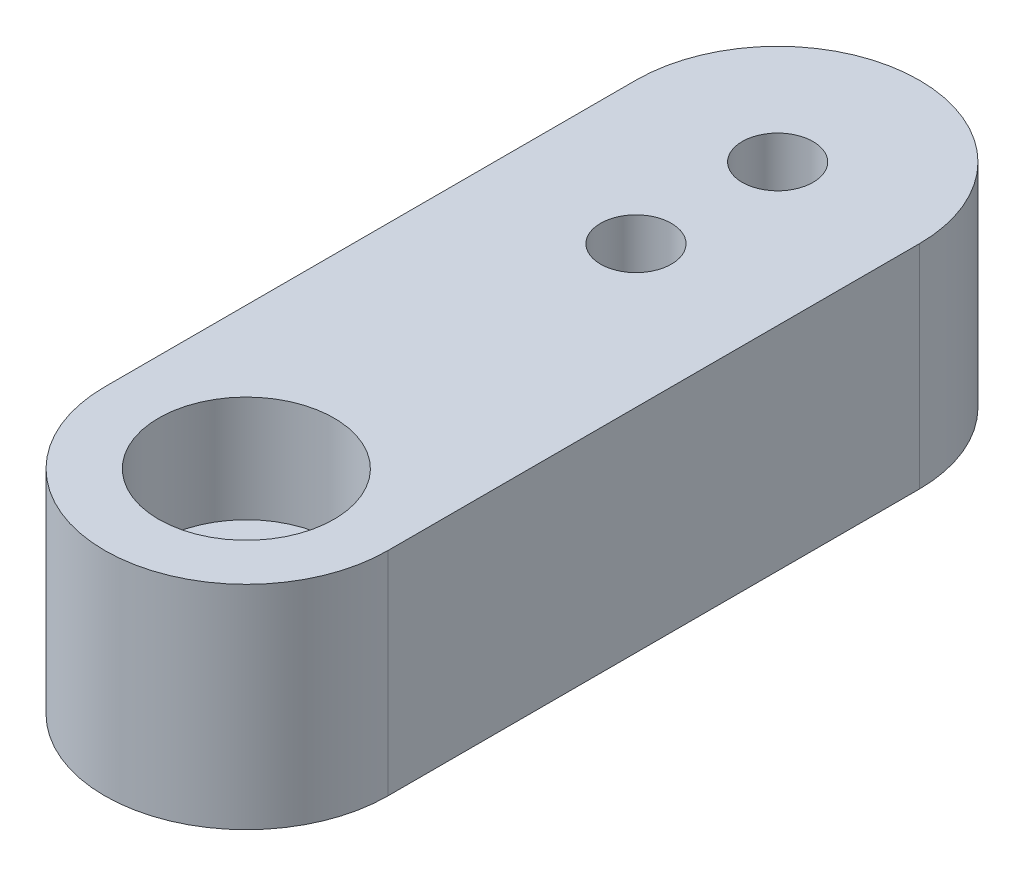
ISO-10303-21;
HEADER;
FILE_DESCRIPTION(('STEP AP214'),'2;1');
FILE_NAME('part.step','',(''),(''),'','','');
FILE_SCHEMA(('AUTOMOTIVE_DESIGN { 1 0 10303 214 1 1 1 1 }'));
ENDSEC;
DATA;
#1=APPLICATION_CONTEXT('core data for automotive mechanical design processes');
#2=APPLICATION_PROTOCOL_DEFINITION('international standard','automotive_design',2000,#1);
#3=PRODUCT_CONTEXT('',#1,'mechanical');
#4=PRODUCT('Part','Part','',(#3));
#5=PRODUCT_RELATED_PRODUCT_CATEGORY('part','',(#4));
#6=PRODUCT_DEFINITION_FORMATION('','',#4);
#7=PRODUCT_DEFINITION_CONTEXT('part definition',#1,'design');
#8=PRODUCT_DEFINITION('design','',#6,#7);
#9=PRODUCT_DEFINITION_SHAPE('','',#8);
#10=(LENGTH_UNIT() NAMED_UNIT(*) SI_UNIT(.MILLI.,.METRE.));
#11=(NAMED_UNIT(*) PLANE_ANGLE_UNIT() SI_UNIT($,.RADIAN.));
#12=(NAMED_UNIT(*) SI_UNIT($,.STERADIAN.) SOLID_ANGLE_UNIT());
#13=UNCERTAINTY_MEASURE_WITH_UNIT(LENGTH_MEASURE(1.E-05),#10,'distance_accuracy_value','');
#14=(GEOMETRIC_REPRESENTATION_CONTEXT(3) GLOBAL_UNCERTAINTY_ASSIGNED_CONTEXT((#13)) GLOBAL_UNIT_ASSIGNED_CONTEXT((#10,
#11,#12)) REPRESENTATION_CONTEXT('',''));
#15=CARTESIAN_POINT('',(0.,0.,0.));
#16=DIRECTION('',(0.,0.,1.));
#17=DIRECTION('',(1.,0.,0.));
#18=AXIS2_PLACEMENT_3D('',#15,#16,#17);
#19=CARTESIAN_POINT('',(4.,6.,15.));
#20=DIRECTION('',(0.,-1.,0.));
#21=DIRECTION('',(0.,0.,-1.));
#22=AXIS2_PLACEMENT_3D('',#19,#20,#21);
#23=CYLINDRICAL_SURFACE('',#22,1.);
#24=CARTESIAN_POINT('',(4.,0.,15.));
#25=DIRECTION('',(0.,1.,0.));
#26=DIRECTION('',(0.,0.,1.));
#27=AXIS2_PLACEMENT_3D('',#24,#25,#26);
#28=CIRCLE('',#27,1.);
#29=CARTESIAN_POINT('',(4.,0.,16.));
#30=VERTEX_POINT('',#29);
#31=EDGE_CURVE('E123',#30,#30,#28,.T.);
#32=ORIENTED_EDGE('',*,*,#31,.F.);
#33=EDGE_LOOP('',(#32));
#34=FACE_BOUND('',#33,.T.);
#35=CARTESIAN_POINT('',(4.,3.,15.));
#36=DIRECTION('',(0.,1.,0.));
#37=DIRECTION('',(0.,0.,1.));
#38=AXIS2_PLACEMENT_3D('',#35,#36,#37);
#39=CIRCLE('',#38,1.);
#40=CARTESIAN_POINT('',(4.,3.,16.));
#41=VERTEX_POINT('',#40);
#42=EDGE_CURVE('E36',#41,#41,#39,.T.);
#43=ORIENTED_EDGE('',*,*,#42,.T.);
#44=EDGE_LOOP('',(#43));
#45=FACE_BOUND('',#44,.T.);
#46=ADVANCED_FACE('F32',(#34,#45),#23,.F.);
#47=CARTESIAN_POINT('',(4.,6.,0.));
#48=DIRECTION('',(0.,1.,0.));
#49=DIRECTION('',(0.,0.,1.));
#50=AXIS2_PLACEMENT_3D('',#47,#48,#49);
#51=PLANE('',#50);
#52=CARTESIAN_POINT('',(4.,6.,15.));
#53=DIRECTION('',(0.,1.,0.));
#54=DIRECTION('',(0.,0.,1.));
#55=AXIS2_PLACEMENT_3D('',#52,#53,#54);
#56=CIRCLE('',#55,2.47702761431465);
#57=CARTESIAN_POINT('',(4.,6.,17.4770276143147));
#58=VERTEX_POINT('',#57);
#59=EDGE_CURVE('E128',#58,#58,#56,.T.);
#60=ORIENTED_EDGE('',*,*,#59,.F.);
#61=EDGE_LOOP('',(#60));
#62=FACE_BOUND('',#61,.T.);
#63=CARTESIAN_POINT('',(4.,6.,4.));
#64=DIRECTION('',(0.,1.,0.));
#65=DIRECTION('',(0.,0.,1.));
#66=AXIS2_PLACEMENT_3D('',#63,#64,#65);
#67=CIRCLE('',#66,1.);
#68=CARTESIAN_POINT('',(4.,6.,5.));
#69=VERTEX_POINT('',#68);
#70=EDGE_CURVE('E117',#69,#69,#67,.T.);
#71=ORIENTED_EDGE('',*,*,#70,.F.);
#72=EDGE_LOOP('',(#71));
#73=FACE_BOUND('',#72,.T.);
#74=CARTESIAN_POINT('',(4.,6.,0.));
#75=DIRECTION('',(0.,1.,0.));
#76=DIRECTION('',(0.,0.,1.));
#77=AXIS2_PLACEMENT_3D('',#74,#75,#76);
#78=CIRCLE('',#77,4.);
#79=CARTESIAN_POINT('',(8.,6.,0.));
#80=VERTEX_POINT('',#79);
#81=CARTESIAN_POINT('',(0.,6.,0.));
#82=VERTEX_POINT('',#81);
#83=EDGE_CURVE('E86',#80,#82,#78,.T.);
#84=ORIENTED_EDGE('',*,*,#83,.T.);
#85=DIRECTION('',(0.,0.,1.));
#86=VECTOR('',#85,1.);
#87=CARTESIAN_POINT('',(0.,6.,0.));
#88=LINE('',#87,#86);
#89=CARTESIAN_POINT('',(0.,6.,15.));
#90=VERTEX_POINT('',#89);
#91=EDGE_CURVE('E80',#82,#90,#88,.T.);
#92=ORIENTED_EDGE('',*,*,#91,.T.);
#93=CARTESIAN_POINT('',(4.,6.,15.));
#94=DIRECTION('',(0.,1.,0.));
#95=DIRECTION('',(0.,0.,1.));
#96=AXIS2_PLACEMENT_3D('',#93,#94,#95);
#97=CIRCLE('',#96,4.);
#98=CARTESIAN_POINT('',(8.,6.,15.));
#99=VERTEX_POINT('',#98);
#100=EDGE_CURVE('E84',#90,#99,#97,.T.);
#101=ORIENTED_EDGE('',*,*,#100,.T.);
#102=DIRECTION('',(0.,0.,-1.));
#103=VECTOR('',#102,1.);
#104=CARTESIAN_POINT('',(8.,6.,0.));
#105=LINE('',#104,#103);
#106=EDGE_CURVE('E50',#99,#80,#105,.T.);
#107=ORIENTED_EDGE('',*,*,#106,.T.);
#108=EDGE_LOOP('',(#84,#92,#101,#107));
#109=FACE_BOUND('',#108,.T.);
#110=CARTESIAN_POINT('',(4.,6.,0.));
#111=DIRECTION('',(0.,1.,0.));
#112=DIRECTION('',(0.,0.,1.));
#113=AXIS2_PLACEMENT_3D('',#110,#111,#112);
#114=CIRCLE('',#113,1.);
#115=CARTESIAN_POINT('',(4.,6.,1.));
#116=VERTEX_POINT('',#115);
#117=EDGE_CURVE('E102',#116,#116,#114,.T.);
#118=ORIENTED_EDGE('',*,*,#117,.F.);
#119=EDGE_LOOP('',(#118));
#120=FACE_BOUND('',#119,.T.);
#121=ADVANCED_FACE('F81',(#62,#73,#109,#120),#51,.T.);
#122=CARTESIAN_POINT('',(4.,0.,0.));
#123=DIRECTION('',(0.,1.,0.));
#124=DIRECTION('',(0.,0.,1.));
#125=AXIS2_PLACEMENT_3D('',#122,#123,#124);
#126=PLANE('',#125);
#127=CARTESIAN_POINT('',(4.,0.,0.));
#128=DIRECTION('',(0.,1.,0.));
#129=DIRECTION('',(0.,0.,1.));
#130=AXIS2_PLACEMENT_3D('',#127,#128,#129);
#131=CIRCLE('',#130,4.);
#132=CARTESIAN_POINT('',(8.,0.,0.));
#133=VERTEX_POINT('',#132);
#134=CARTESIAN_POINT('',(0.,0.,0.));
#135=VERTEX_POINT('',#134);
#136=EDGE_CURVE('E99',#133,#135,#131,.T.);
#137=ORIENTED_EDGE('',*,*,#136,.F.);
#138=DIRECTION('',(0.,0.,-1.));
#139=VECTOR('',#138,1.);
#140=CARTESIAN_POINT('',(8.,0.,0.));
#141=LINE('',#140,#139);
#142=CARTESIAN_POINT('',(8.,0.,15.));
#143=VERTEX_POINT('',#142);
#144=EDGE_CURVE('E73',#143,#133,#141,.T.);
#145=ORIENTED_EDGE('',*,*,#144,.F.);
#146=CARTESIAN_POINT('',(4.,0.,15.));
#147=DIRECTION('',(0.,1.,0.));
#148=DIRECTION('',(0.,0.,1.));
#149=AXIS2_PLACEMENT_3D('',#146,#147,#148);
#150=CIRCLE('',#149,4.);
#151=CARTESIAN_POINT('',(0.,0.,15.));
#152=VERTEX_POINT('',#151);
#153=EDGE_CURVE('E67',#152,#143,#150,.T.);
#154=ORIENTED_EDGE('',*,*,#153,.F.);
#155=DIRECTION('',(0.,0.,1.));
#156=VECTOR('',#155,1.);
#157=CARTESIAN_POINT('',(0.,0.,0.));
#158=LINE('',#157,#156);
#159=EDGE_CURVE('E90',#135,#152,#158,.T.);
#160=ORIENTED_EDGE('',*,*,#159,.F.);
#161=EDGE_LOOP('',(#137,#145,#154,#160));
#162=FACE_BOUND('',#161,.T.);
#163=CARTESIAN_POINT('',(4.,0.,0.));
#164=DIRECTION('',(0.,1.,0.));
#165=DIRECTION('',(0.,0.,1.));
#166=AXIS2_PLACEMENT_3D('',#163,#164,#165);
#167=CIRCLE('',#166,1.);
#168=CARTESIAN_POINT('',(4.,0.,1.));
#169=VERTEX_POINT('',#168);
#170=EDGE_CURVE('E114',#169,#169,#167,.T.);
#171=ORIENTED_EDGE('',*,*,#170,.T.);
#172=EDGE_LOOP('',(#171));
#173=FACE_BOUND('',#172,.T.);
#174=CARTESIAN_POINT('',(4.,0.,4.));
#175=DIRECTION('',(0.,1.,0.));
#176=DIRECTION('',(0.,0.,1.));
#177=AXIS2_PLACEMENT_3D('',#174,#175,#176);
#178=CIRCLE('',#177,1.);
#179=CARTESIAN_POINT('',(4.,0.,5.));
#180=VERTEX_POINT('',#179);
#181=EDGE_CURVE('E120',#180,#180,#178,.T.);
#182=ORIENTED_EDGE('',*,*,#181,.T.);
#183=EDGE_LOOP('',(#182));
#184=FACE_BOUND('',#183,.T.);
#185=ORIENTED_EDGE('',*,*,#31,.T.);
#186=EDGE_LOOP('',(#185));
#187=FACE_BOUND('',#186,.T.);
#188=ADVANCED_FACE('F110',(#162,#173,#184,#187),#126,.F.);
#189=CARTESIAN_POINT('',(4.,6.,0.));
#190=DIRECTION('',(0.,-1.,0.));
#191=DIRECTION('',(0.,0.,-1.));
#192=AXIS2_PLACEMENT_3D('',#189,#190,#191);
#193=CYLINDRICAL_SURFACE('',#192,4.);
#194=ORIENTED_EDGE('',*,*,#136,.T.);
#195=DIRECTION('',(0.,-1.,0.));
#196=VECTOR('',#195,1.);
#197=CARTESIAN_POINT('',(0.,6.,0.));
#198=LINE('',#197,#196);
#199=EDGE_CURVE('E11',#82,#135,#198,.T.);
#200=ORIENTED_EDGE('',*,*,#199,.F.);
#201=ORIENTED_EDGE('',*,*,#83,.F.);
#202=DIRECTION('',(0.,-1.,0.));
#203=VECTOR('',#202,1.);
#204=CARTESIAN_POINT('',(8.,6.,0.));
#205=LINE('',#204,#203);
#206=EDGE_CURVE('E95',#80,#133,#205,.T.);
#207=ORIENTED_EDGE('',*,*,#206,.T.);
#208=EDGE_LOOP('',(#194,#200,#201,#207));
#209=FACE_BOUND('',#208,.T.);
#210=ADVANCED_FACE('F34',(#209),#193,.T.);
#211=CARTESIAN_POINT('',(0.,6.,0.));
#212=DIRECTION('',(1.,0.,0.));
#213=DIRECTION('',(0.,0.,-1.));
#214=AXIS2_PLACEMENT_3D('',#211,#212,#213);
#215=PLANE('',#214);
#216=ORIENTED_EDGE('',*,*,#159,.T.);
#217=DIRECTION('',(0.,-1.,0.));
#218=VECTOR('',#217,1.);
#219=CARTESIAN_POINT('',(0.,6.,15.));
#220=LINE('',#219,#218);
#221=EDGE_CURVE('E42',#90,#152,#220,.T.);
#222=ORIENTED_EDGE('',*,*,#221,.F.);
#223=ORIENTED_EDGE('',*,*,#91,.F.);
#224=ORIENTED_EDGE('',*,*,#199,.T.);
#225=EDGE_LOOP('',(#216,#222,#223,#224));
#226=FACE_BOUND('',#225,.T.);
#227=ADVANCED_FACE('F89',(#226),#215,.F.);
#228=CARTESIAN_POINT('',(4.,6.,15.));
#229=DIRECTION('',(0.,-1.,0.));
#230=DIRECTION('',(0.,0.,-1.));
#231=AXIS2_PLACEMENT_3D('',#228,#229,#230);
#232=CYLINDRICAL_SURFACE('',#231,4.);
#233=ORIENTED_EDGE('',*,*,#153,.T.);
#234=DIRECTION('',(0.,-1.,0.));
#235=VECTOR('',#234,1.);
#236=CARTESIAN_POINT('',(8.,6.,15.));
#237=LINE('',#236,#235);
#238=EDGE_CURVE('E91',#99,#143,#237,.T.);
#239=ORIENTED_EDGE('',*,*,#238,.F.);
#240=ORIENTED_EDGE('',*,*,#100,.F.);
#241=ORIENTED_EDGE('',*,*,#221,.T.);
#242=EDGE_LOOP('',(#233,#239,#240,#241));
#243=FACE_BOUND('',#242,.T.);
#244=ADVANCED_FACE('F93',(#243),#232,.T.);
#245=CARTESIAN_POINT('',(8.,6.,0.));
#246=DIRECTION('',(-1.,0.,0.));
#247=DIRECTION('',(0.,0.,1.));
#248=AXIS2_PLACEMENT_3D('',#245,#246,#247);
#249=PLANE('',#248);
#250=ORIENTED_EDGE('',*,*,#144,.T.);
#251=ORIENTED_EDGE('',*,*,#206,.F.);
#252=ORIENTED_EDGE('',*,*,#106,.F.);
#253=ORIENTED_EDGE('',*,*,#238,.T.);
#254=EDGE_LOOP('',(#250,#251,#252,#253));
#255=FACE_BOUND('',#254,.T.);
#256=ADVANCED_FACE('F107',(#255),#249,.F.);
#257=CARTESIAN_POINT('',(4.,6.,0.));
#258=DIRECTION('',(0.,-1.,0.));
#259=DIRECTION('',(0.,0.,-1.));
#260=AXIS2_PLACEMENT_3D('',#257,#258,#259);
#261=CYLINDRICAL_SURFACE('',#260,1.);
#262=ORIENTED_EDGE('',*,*,#117,.T.);
#263=EDGE_LOOP('',(#262));
#264=FACE_BOUND('',#263,.T.);
#265=ORIENTED_EDGE('',*,*,#170,.F.);
#266=EDGE_LOOP('',(#265));
#267=FACE_BOUND('',#266,.T.);
#268=ADVANCED_FACE('F161',(#264,#267),#261,.F.);
#269=CARTESIAN_POINT('',(4.,6.,4.));
#270=DIRECTION('',(0.,-1.,0.));
#271=DIRECTION('',(0.,0.,-1.));
#272=AXIS2_PLACEMENT_3D('',#269,#270,#271);
#273=CYLINDRICAL_SURFACE('',#272,1.);
#274=ORIENTED_EDGE('',*,*,#70,.T.);
#275=EDGE_LOOP('',(#274));
#276=FACE_BOUND('',#275,.T.);
#277=ORIENTED_EDGE('',*,*,#181,.F.);
#278=EDGE_LOOP('',(#277));
#279=FACE_BOUND('',#278,.T.);
#280=ADVANCED_FACE('F146',(#276,#279),#273,.F.);
#281=CARTESIAN_POINT('',(4.,3.,15.));
#282=DIRECTION('',(0.,1.,0.));
#283=DIRECTION('',(0.,0.,1.));
#284=AXIS2_PLACEMENT_3D('',#281,#282,#283);
#285=CYLINDRICAL_SURFACE('',#284,2.47702761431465);
#286=CARTESIAN_POINT('',(4.,3.,15.));
#287=DIRECTION('',(0.,1.,0.));
#288=DIRECTION('',(0.,0.,1.));
#289=AXIS2_PLACEMENT_3D('',#286,#287,#288);
#290=CIRCLE('',#289,2.47702761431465);
#291=CARTESIAN_POINT('',(4.,3.,17.4770276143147));
#292=VERTEX_POINT('',#291);
#293=EDGE_CURVE('E131',#292,#292,#290,.T.);
#294=ORIENTED_EDGE('',*,*,#293,.F.);
#295=EDGE_LOOP('',(#294));
#296=FACE_BOUND('',#295,.T.);
#297=ORIENTED_EDGE('',*,*,#59,.T.);
#298=EDGE_LOOP('',(#297));
#299=FACE_BOUND('',#298,.T.);
#300=ADVANCED_FACE('F141',(#296,#299),#285,.F.);
#301=CARTESIAN_POINT('',(4.,3.,15.));
#302=DIRECTION('',(0.,1.,0.));
#303=DIRECTION('',(0.,0.,1.));
#304=AXIS2_PLACEMENT_3D('',#301,#302,#303);
#305=PLANE('',#304);
#306=ORIENTED_EDGE('',*,*,#42,.F.);
#307=EDGE_LOOP('',(#306));
#308=FACE_BOUND('',#307,.T.);
#309=ORIENTED_EDGE('',*,*,#293,.T.);
#310=EDGE_LOOP('',(#309));
#311=FACE_BOUND('',#310,.T.);
#312=ADVANCED_FACE('F139',(#308,#311),#305,.T.);
#313=CLOSED_SHELL('',(#46,#121,#188,#210,#227,#244,#256,#268,#280,#300,#312));
#314=MANIFOLD_SOLID_BREP('B2',#313);
#315=ADVANCED_BREP_SHAPE_REPRESENTATION('',(#18,#314),#14);
#316=SHAPE_DEFINITION_REPRESENTATION(#9,#315);
ENDSEC;
END-ISO-10303-21;
